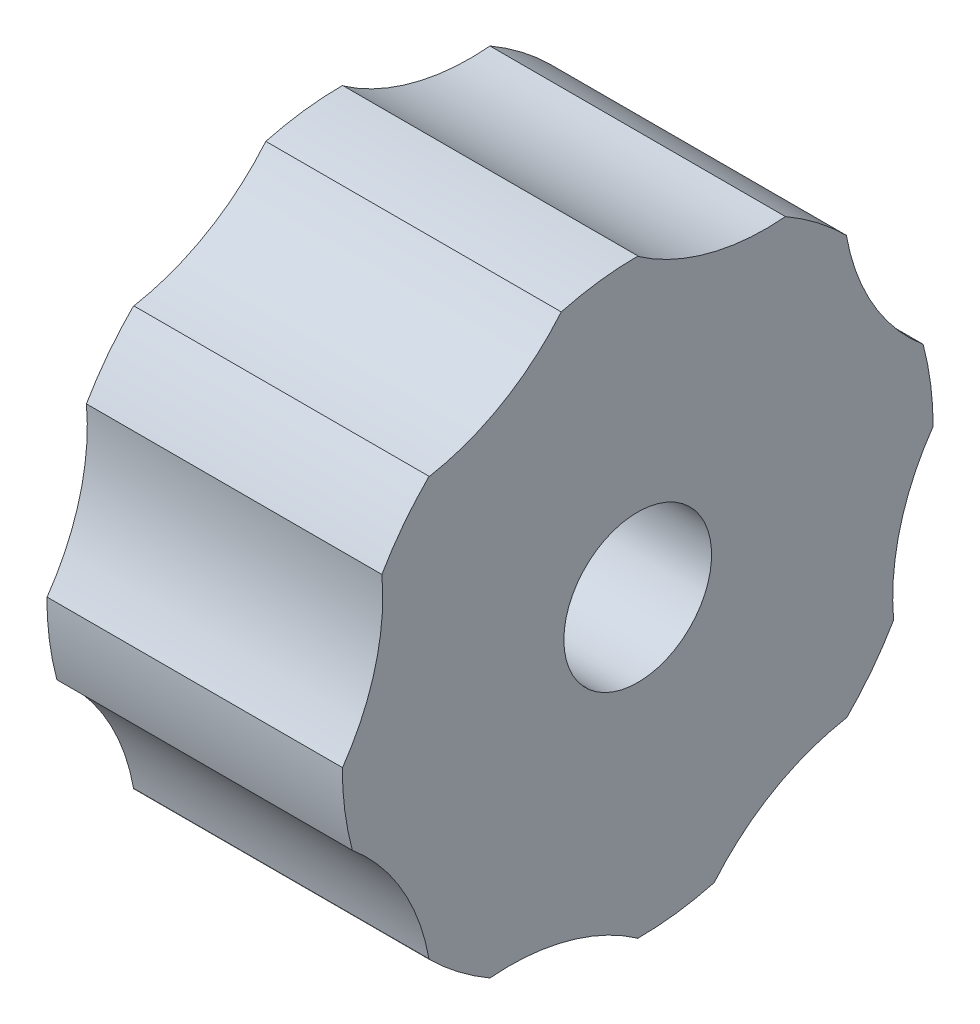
from build123d import *

# Parameters (mm, degrees)
ENL_V_MAT_EXTRU_9_DEPTH      = 10
R_P_TITION_CIRCULAIRE1_COUNT = 8
ESQUISSE3_R                  = 4.890403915
ENL_V_MAT_EXTRU_10_DEPTH     = 30
ESQUISSE4_R                  = 2.5
ENL_V_MAT_EXTRU_11_DEPTH     = 10


with BuildPart() as part:
    # Esquisse1 → R_volution1 (revolve)
    with BuildSketch(Plane.XY, mode=Mode.PRIVATE) as r_volution1_sk:
        Polygon((0, 0), (-40, 0), (-40, 3), (-10, 3), (-10, 10), (0, 10), align=None)
    revolve(r_volution1_sk.sketch.rotate(Axis((0, 0, 0), (1, 0, 0)), 90), axis=Axis((0, 0, 0), (1, 0, 0)))

    # Esquisse2 → Enl_v. mat.-Extru.9 (cut)
    with BuildSketch(Plane(origin=(-10, 0, 0), x_dir=(0, 0, -1), z_dir=(1, 0, 0))):
        with BuildLine():
            ThreePointArc((0, 9.992602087), (2.382597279, 8.885842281), (5, 8.660254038))
            ThreePointArc((5, 8.660254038), (2.813446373, 10.502721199), (0, 9.992602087))
        make_face()
    enl_v_mat_extru_9 = extrude(amount=ENL_V_MAT_EXTRU_9_DEPTH, mode=Mode.SUBTRACT)

    # R_p_tition circulaire1: Enl_v. mat.-Extru.9 ×8 about axis
    r_p_tition_circulaire1_axis = Axis((0, 0, 0), (1, 0, 0))
    for i in range(1, R_P_TITION_CIRCULAIRE1_COUNT):
        add(enl_v_mat_extru_9.rotate(r_p_tition_circulaire1_axis, i * 360 / R_P_TITION_CIRCULAIRE1_COUNT), mode=Mode.SUBTRACT)

    # Esquisse3 → Enl_v. mat.-Extru.10 (cut)
    with BuildSketch(Plane.ZY.offset(40)):
        Circle(ESQUISSE3_R)
    extrude(amount=-ENL_V_MAT_EXTRU_10_DEPTH, mode=Mode.SUBTRACT)

    # Esquisse4 → Enl_v. mat.-Extru.11 (cut)
    with BuildSketch(Plane.ZY.offset(10)):
        Circle(ESQUISSE4_R)
    extrude(amount=-ENL_V_MAT_EXTRU_11_DEPTH, mode=Mode.SUBTRACT)


solid = part.part
